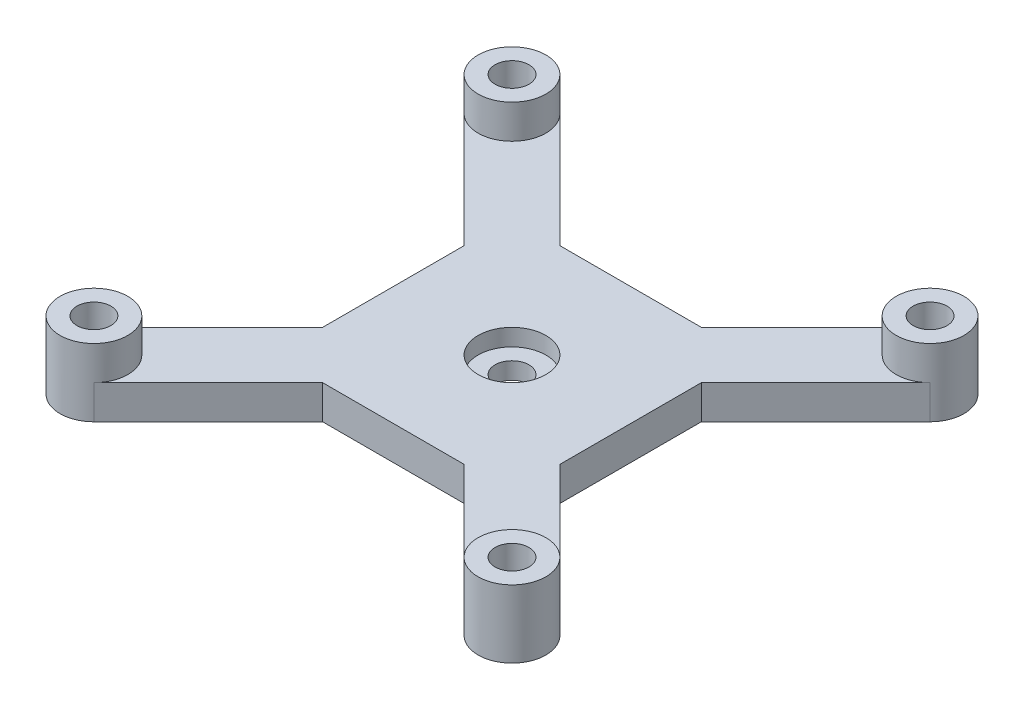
from build123d import *

# Parameters (mm, degrees)
ESBO_O1_R                = 1.5
RESSALTO_EXTRUS_O1_DEPTH = 3
CORTE_EXTRUS_O1_START    = -1.5
ESBO_O2_R                = 3
ESBO_O2_R_2              = 1.5
CORTE_EXTRUS_O1_DEPTH    = 1.5
ESBO_O3_R                = 3
ESBO_O3_R_2              = 1.5
RESSALTO_EXTRUS_O2_DEPTH = 3


with BuildPart() as part:
    # Esbo_o1 → Ressalto-extrus_o1 (new body)
    with BuildSketch(Plane(origin=(0, 0, 0), x_dir=(1, 0, 0), z_dir=(0, 1, 0))):
        with BuildLine():
            Line((-30.020469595, 7.896668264), (-19.899149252, -2.224652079))
            Line((-19.899149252, -2.224652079), (-19.899149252, -14.739370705))
            Line((-19.899149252, -14.739370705), (-30.020469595, -24.860691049))
            ThreePointArc((-30.020469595, -24.860691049), (-30.020469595, -29.103331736), (-25.777828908, -29.103331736))
            Line((-25.777828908, -29.103331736), (-15.656508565, -18.982011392))
            Line((-15.656508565, -18.982011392), (-3.141789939, -18.982011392))
            Line((-3.141789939, -18.982011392), (6.979530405, -29.103331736))
            ThreePointArc((6.979530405, -29.103331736), (11.222171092, -29.103331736), (11.222171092, -24.860691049))
            Line((11.222171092, -24.860691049), (1.100850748, -14.739370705))
            Line((1.100850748, -14.739370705), (1.100850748, -2.224652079))
            Line((1.100850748, -2.224652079), (11.222171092, 7.896668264))
            ThreePointArc((11.222171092, 7.896668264), (11.222171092, 12.139308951), (6.979530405, 12.139308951))
            Line((6.979530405, 12.139308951), (-3.141789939, 2.017988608))
            Line((-3.141789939, 2.017988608), (-15.656508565, 2.017988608))
            Line((-15.656508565, 2.017988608), (-25.777828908, 12.139308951))
            ThreePointArc((-25.777828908, 12.139308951), (-30.020469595, 12.139308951), (-30.020469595, 7.896668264))
        make_face()
        with Locations(Location((-27.899149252, 10.017988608, 0), (0, 0, 270))):
            Circle(ESBO_O1_R, mode=Mode.SUBTRACT)
        with Locations(Location((9.100850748, 10.017988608, 0), (0, 0, 270))):
            Circle(ESBO_O1_R, mode=Mode.SUBTRACT)
        with Locations(Location((9.100850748, -26.982011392, 0), (0, 0, 270))):
            Circle(ESBO_O1_R, mode=Mode.SUBTRACT)
        with Locations(Location((-27.899149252, -26.982011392, 0), (0, 0, 270))):
            Circle(ESBO_O1_R, mode=Mode.SUBTRACT)
        with Locations(Location((-9.399149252, -8.482011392, 0), (0, 0, 270))):
            Circle(ESBO_O1_R, mode=Mode.SUBTRACT)
    extrude(amount=RESSALTO_EXTRUS_O1_DEPTH)

    # Esbo_o2 → Corte-extrus_o1 (cut)
    with BuildSketch(Plane(origin=(0, 3, 0), x_dir=(1, 0, 0), z_dir=(0, 1, 0)).offset(CORTE_EXTRUS_O1_START)):
        with Locations(Location((-9.399149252, -8.482011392, 0), (0, 0, 270))):
            Circle(ESBO_O2_R)
        with Locations(Location((-9.399149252, -8.482011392, 0), (0, 0, 270))):
            Circle(ESBO_O2_R_2, mode=Mode.SUBTRACT)
    extrude(amount=CORTE_EXTRUS_O1_DEPTH, mode=Mode.SUBTRACT)

    # Esbo_o3 → Ressalto-extrus_o2 (add)
    # profile 1 of 4: a face of its own
    with BuildSketch(Plane(origin=(0, 3, 0), x_dir=(1, 0, 0), z_dir=(0, 1, 0))):
        with Locations(Location((-27.899149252, 10.017988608, 0), (0, 0, 45))):
            Circle(ESBO_O3_R)
        with Locations(Location((-27.899149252, 10.017988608, 0), (0, 0, 270))):
            Circle(ESBO_O3_R_2, mode=Mode.SUBTRACT)
    # profile 2 of 4: a face of its own
    with BuildSketch(Plane(origin=(0, 3, 0), x_dir=(1, 0, 0), z_dir=(0, 1, 0))):
        with Locations(Location((9.100850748, 10.017988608, 0), (0, 0, 135))):
            Circle(ESBO_O3_R)
        with Locations(Location((9.100850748, 10.017988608, 0), (0, 0, 270))):
            Circle(ESBO_O3_R_2, mode=Mode.SUBTRACT)
    # profile 3 of 4: a face of its own
    with BuildSketch(Plane(origin=(0, 3, 0), x_dir=(1, 0, 0), z_dir=(0, 1, 0))):
        with Locations(Location((9.100850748, -26.982011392, 0), (0, 0, 45))):
            Circle(ESBO_O3_R)
        with Locations(Location((9.100850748, -26.982011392, 0), (0, 0, 270))):
            Circle(ESBO_O3_R_2, mode=Mode.SUBTRACT)
    # profile 4 of 4: a face of its own
    with BuildSketch(Plane(origin=(0, 3, 0), x_dir=(1, 0, 0), z_dir=(0, 1, 0))):
        with Locations(Location((-27.899149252, -26.982011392, 0), (0, 0, 135))):
            Circle(ESBO_O3_R)
        with Locations(Location((-27.899149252, -26.982011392, 0), (0, 0, 270))):
            Circle(ESBO_O3_R_2, mode=Mode.SUBTRACT)
    extrude(amount=RESSALTO_EXTRUS_O2_DEPTH)


solid = part.part
